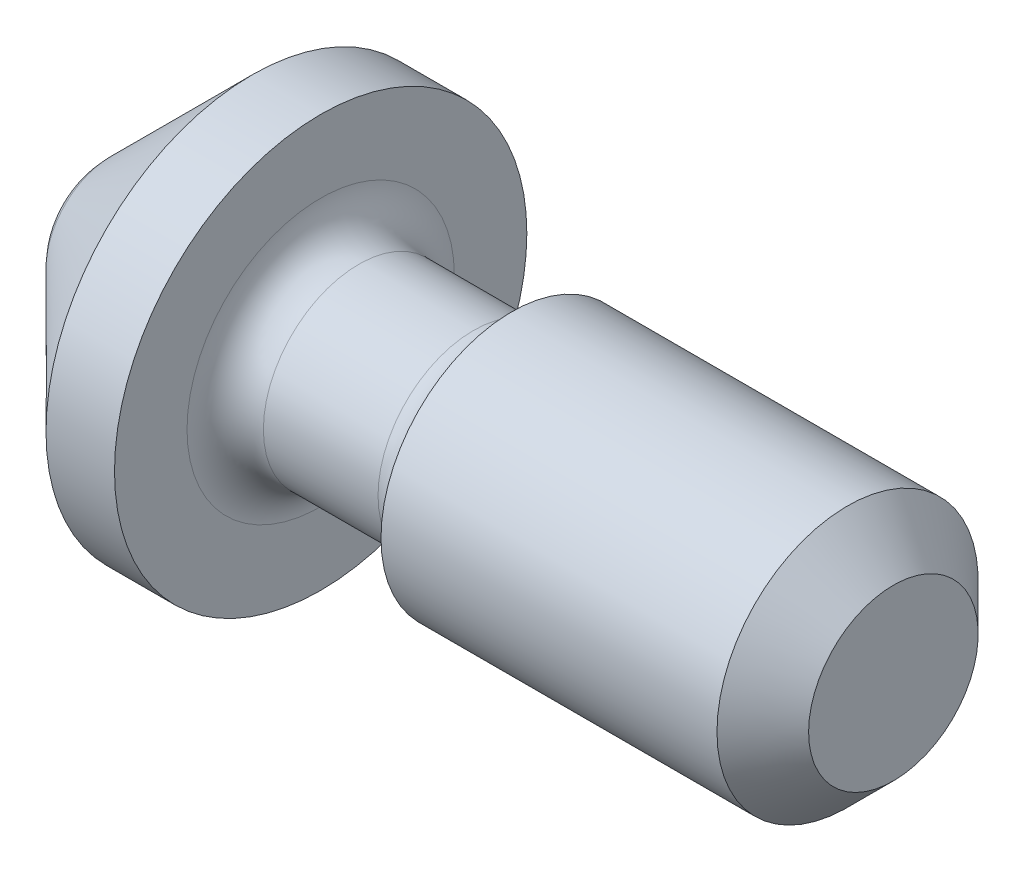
ISO-10303-21;
HEADER;
FILE_DESCRIPTION(('STEP AP214'),'2;1');
FILE_NAME('part.step','',(''),(''),'','','');
FILE_SCHEMA(('AUTOMOTIVE_DESIGN { 1 0 10303 214 1 1 1 1 }'));
ENDSEC;
DATA;
#1=APPLICATION_CONTEXT('core data for automotive mechanical design processes');
#2=APPLICATION_PROTOCOL_DEFINITION('international standard','automotive_design',2000,#1);
#3=PRODUCT_CONTEXT('',#1,'mechanical');
#4=PRODUCT('Part','Part','',(#3));
#5=PRODUCT_RELATED_PRODUCT_CATEGORY('part','',(#4));
#6=PRODUCT_DEFINITION_FORMATION('','',#4);
#7=PRODUCT_DEFINITION_CONTEXT('part definition',#1,'design');
#8=PRODUCT_DEFINITION('design','',#6,#7);
#9=PRODUCT_DEFINITION_SHAPE('','',#8);
#10=(LENGTH_UNIT() NAMED_UNIT(*) SI_UNIT(.MILLI.,.METRE.));
#11=(NAMED_UNIT(*) PLANE_ANGLE_UNIT() SI_UNIT($,.RADIAN.));
#12=(NAMED_UNIT(*) SI_UNIT($,.STERADIAN.) SOLID_ANGLE_UNIT());
#13=UNCERTAINTY_MEASURE_WITH_UNIT(LENGTH_MEASURE(1.E-05),#10,'distance_accuracy_value','');
#14=(GEOMETRIC_REPRESENTATION_CONTEXT(3) GLOBAL_UNCERTAINTY_ASSIGNED_CONTEXT((#13)) GLOBAL_UNIT_ASSIGNED_CONTEXT((#10,
#11,#12)) REPRESENTATION_CONTEXT('',''));
#15=CARTESIAN_POINT('',(0.,0.,0.));
#16=DIRECTION('',(0.,0.,1.));
#17=DIRECTION('',(1.,0.,0.));
#18=AXIS2_PLACEMENT_3D('',#15,#16,#17);
#19=CARTESIAN_POINT('',(1.524,0.,0.));
#20=DIRECTION('',(-1.,0.,0.));
#21=DIRECTION('',(0.,1.,0.));
#22=AXIS2_PLACEMENT_3D('',#19,#20,#21);
#23=SPHERICAL_SURFACE('',#22,1.524);
#24=CARTESIAN_POINT('',(0.446369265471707,0.,0.));
#25=DIRECTION('',(-1.,0.,0.));
#26=DIRECTION('',(0.,0.,1.));
#27=AXIS2_PLACEMENT_3D('',#24,#25,#26);
#28=CIRCLE('',#27,1.0776307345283);
#29=CARTESIAN_POINT('',(0.446369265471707,0.,-1.0776307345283));
#30=VERTEX_POINT('',#29);
#31=EDGE_CURVE('E61',#30,#30,#28,.T.);
#32=ORIENTED_EDGE('',*,*,#31,.T.);
#33=EDGE_LOOP('',(#32));
#34=FACE_BOUND('',#33,.T.);
#35=ADVANCED_FACE('F29',(#34),#23,.T.);
#36=CARTESIAN_POINT('',(13.462,0.,0.));
#37=DIRECTION('',(-1.,0.,0.));
#38=DIRECTION('',(0.,0.,1.));
#39=AXIS2_PLACEMENT_3D('',#36,#37,#38);
#40=PLANE('',#39);
#41=CARTESIAN_POINT('',(13.462,0.,0.));
#42=DIRECTION('',(-1.,0.,0.));
#43=DIRECTION('',(0.,0.,1.));
#44=AXIS2_PLACEMENT_3D('',#41,#42,#43);
#45=CIRCLE('',#44,1.41);
#46=CARTESIAN_POINT('',(13.462,0.,1.41));
#47=VERTEX_POINT('',#46);
#48=EDGE_CURVE('E44',#47,#47,#45,.F.);
#49=ORIENTED_EDGE('',*,*,#48,.T.);
#50=EDGE_LOOP('',(#49));
#51=FACE_BOUND('',#50,.T.);
#52=ADVANCED_FACE('F90',(#51),#40,.F.);
#53=CARTESIAN_POINT('',(0.,0.,0.));
#54=DIRECTION('',(-1.,0.,0.));
#55=DIRECTION('',(0.,0.,1.));
#56=AXIS2_PLACEMENT_3D('',#53,#54,#55);
#57=CYLINDRICAL_SURFACE('',#56,2.172);
#58=CARTESIAN_POINT('',(12.7,0.,0.));
#59=DIRECTION('',(-1.,0.,0.));
#60=DIRECTION('',(0.,0.,1.));
#61=AXIS2_PLACEMENT_3D('',#58,#59,#60);
#62=CIRCLE('',#61,2.172);
#63=CARTESIAN_POINT('',(12.7,0.,2.172));
#64=VERTEX_POINT('',#63);
#65=EDGE_CURVE('E49',#64,#64,#62,.T.);
#66=ORIENTED_EDGE('',*,*,#65,.T.);
#67=EDGE_LOOP('',(#66));
#68=FACE_BOUND('',#67,.T.);
#69=CARTESIAN_POINT('',(7.112,0.,0.));
#70=DIRECTION('',(-1.,0.,0.));
#71=DIRECTION('',(0.,0.,1.));
#72=AXIS2_PLACEMENT_3D('',#69,#70,#71);
#73=CIRCLE('',#72,2.172);
#74=CARTESIAN_POINT('',(7.112,0.,2.172));
#75=VERTEX_POINT('',#74);
#76=EDGE_CURVE('E52',#75,#75,#73,.T.);
#77=ORIENTED_EDGE('',*,*,#76,.F.);
#78=EDGE_LOOP('',(#77));
#79=FACE_BOUND('',#78,.T.);
#80=ADVANCED_FACE('F87',(#68,#79),#57,.T.);
#81=CARTESIAN_POINT('',(0.,0.,0.));
#82=DIRECTION('',(-1.,0.,0.));
#83=DIRECTION('',(0.,0.,1.));
#84=AXIS2_PLACEMENT_3D('',#81,#82,#83);
#85=CYLINDRICAL_SURFACE('',#84,1.588);
#86=CARTESIAN_POINT('',(4.572,0.,0.));
#87=DIRECTION('',(-1.,0.,0.));
#88=DIRECTION('',(0.,0.,1.));
#89=AXIS2_PLACEMENT_3D('',#86,#87,#88);
#90=CIRCLE('',#89,1.588);
#91=CARTESIAN_POINT('',(4.572,0.,1.588));
#92=VERTEX_POINT('',#91);
#93=EDGE_CURVE('E10',#92,#92,#90,.F.);
#94=ORIENTED_EDGE('',*,*,#93,.T.);
#95=EDGE_LOOP('',(#94));
#96=FACE_BOUND('',#95,.T.);
#97=CARTESIAN_POINT('',(6.47905134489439,0.,0.));
#98=DIRECTION('',(1.,0.,0.));
#99=DIRECTION('',(0.,0.,-1.));
#100=AXIS2_PLACEMENT_3D('',#97,#98,#99);
#101=CIRCLE('',#100,1.588);
#102=CARTESIAN_POINT('',(6.47905134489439,0.,-1.588));
#103=VERTEX_POINT('',#102);
#104=EDGE_CURVE('E36',#103,#103,#101,.F.);
#105=ORIENTED_EDGE('',*,*,#104,.T.);
#106=EDGE_LOOP('',(#105));
#107=FACE_BOUND('',#106,.T.);
#108=ADVANCED_FACE('F81',(#96,#107),#85,.T.);
#109=CARTESIAN_POINT('',(3.937,1.588,0.));
#110=DIRECTION('',(-1.,0.,0.));
#111=DIRECTION('',(0.,0.,1.));
#112=AXIS2_PLACEMENT_3D('',#109,#110,#111);
#113=PLANE('',#112);
#114=CARTESIAN_POINT('',(3.937,0.,0.));
#115=DIRECTION('',(-1.,0.,0.));
#116=DIRECTION('',(0.,0.,1.));
#117=AXIS2_PLACEMENT_3D('',#114,#115,#116);
#118=CIRCLE('',#117,2.223);
#119=CARTESIAN_POINT('',(3.937,0.,2.223));
#120=VERTEX_POINT('',#119);
#121=EDGE_CURVE('E40',#120,#120,#118,.T.);
#122=ORIENTED_EDGE('',*,*,#121,.T.);
#123=EDGE_LOOP('',(#122));
#124=FACE_BOUND('',#123,.T.);
#125=CARTESIAN_POINT('',(3.937,0.,0.));
#126=DIRECTION('',(-1.,0.,0.));
#127=DIRECTION('',(0.,0.,1.));
#128=AXIS2_PLACEMENT_3D('',#125,#126,#127);
#129=CIRCLE('',#128,3.429);
#130=CARTESIAN_POINT('',(3.937,0.,3.429));
#131=VERTEX_POINT('',#130);
#132=EDGE_CURVE('E55',#131,#131,#129,.T.);
#133=ORIENTED_EDGE('',*,*,#132,.F.);
#134=EDGE_LOOP('',(#133));
#135=FACE_BOUND('',#134,.T.);
#136=ADVANCED_FACE('F76',(#124,#135),#113,.F.);
#137=CARTESIAN_POINT('',(0.,0.,0.));
#138=DIRECTION('',(-1.,0.,0.));
#139=DIRECTION('',(0.,0.,1.));
#140=AXIS2_PLACEMENT_3D('',#137,#138,#139);
#141=CYLINDRICAL_SURFACE('',#140,3.429);
#142=CARTESIAN_POINT('',(2.79773853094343,0.,0.));
#143=DIRECTION('',(-1.,0.,0.));
#144=DIRECTION('',(0.,0.,1.));
#145=AXIS2_PLACEMENT_3D('',#142,#143,#144);
#146=CIRCLE('',#145,3.429);
#147=CARTESIAN_POINT('',(2.79773853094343,0.,-3.429));
#148=VERTEX_POINT('',#147);
#149=EDGE_CURVE('E58',#148,#148,#146,.T.);
#150=ORIENTED_EDGE('',*,*,#149,.F.);
#151=EDGE_LOOP('',(#150));
#152=FACE_BOUND('',#151,.T.);
#153=ORIENTED_EDGE('',*,*,#132,.T.);
#154=EDGE_LOOP('',(#153));
#155=FACE_BOUND('',#154,.T.);
#156=ADVANCED_FACE('F70',(#152,#155),#141,.T.);
#157=CARTESIAN_POINT('',(2.79773853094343,0.,0.));
#158=DIRECTION('',(1.,0.,0.));
#159=DIRECTION('',(0.,0.,-1.));
#160=AXIS2_PLACEMENT_3D('',#157,#158,#159);
#161=CONICAL_SURFACE('',#160,3.429,0.785398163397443);
#162=CARTESIAN_POINT('',(0.446369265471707,0.,-1.0776307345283));
#163=CARTESIAN_POINT('',(0.470862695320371,0.,-1.10212416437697));
#164=CARTESIAN_POINT('',(0.495356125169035,0.,-1.12661759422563));
#165=CARTESIAN_POINT('',(0.544342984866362,0.,-1.17560445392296));
#166=CARTESIAN_POINT('',(0.568836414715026,0.,-1.20009788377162));
#167=CARTESIAN_POINT('',(0.617823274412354,0.,-1.24908474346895));
#168=CARTESIAN_POINT('',(0.642316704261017,0.,-1.27357817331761));
#169=CARTESIAN_POINT('',(0.691303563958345,0.,-1.32256503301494));
#170=CARTESIAN_POINT('',(0.715796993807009,0.,-1.3470584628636));
#171=CARTESIAN_POINT('',(0.764783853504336,0.,-1.39604532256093));
#172=CARTESIAN_POINT('',(0.789277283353,0.,-1.42053875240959));
#173=CARTESIAN_POINT('',(0.838264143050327,0.,-1.46952561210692));
#174=CARTESIAN_POINT('',(0.862757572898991,0.,-1.49401904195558));
#175=CARTESIAN_POINT('',(0.911744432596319,0.,-1.54300590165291));
#176=CARTESIAN_POINT('',(0.936237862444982,0.,-1.56749933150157));
#177=CARTESIAN_POINT('',(0.98522472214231,0.,-1.6164861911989));
#178=CARTESIAN_POINT('',(1.00971815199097,0.,-1.64097962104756));
#179=CARTESIAN_POINT('',(1.0587050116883,0.,-1.68996648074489));
#180=CARTESIAN_POINT('',(1.08319844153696,0.,-1.71445991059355));
#181=CARTESIAN_POINT('',(1.13218530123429,0.,-1.76344677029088));
#182=CARTESIAN_POINT('',(1.15667873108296,0.,-1.78794020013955));
#183=CARTESIAN_POINT('',(1.20566559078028,0.,-1.83692705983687));
#184=CARTESIAN_POINT('',(1.23015902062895,0.,-1.86142048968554));
#185=CARTESIAN_POINT('',(1.27914588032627,0.,-1.91040734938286));
#186=CARTESIAN_POINT('',(1.30363931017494,0.,-1.93490077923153));
#187=CARTESIAN_POINT('',(1.35262616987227,0.,-1.98388763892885));
#188=CARTESIAN_POINT('',(1.37711959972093,0.,-2.00838106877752));
#189=CARTESIAN_POINT('',(1.42610645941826,0.,-2.05736792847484));
#190=CARTESIAN_POINT('',(1.45059988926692,0.,-2.08186135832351));
#191=CARTESIAN_POINT('',(1.49958674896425,0.,-2.13084821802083));
#192=CARTESIAN_POINT('',(1.52408017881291,0.,-2.1553416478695));
#193=CARTESIAN_POINT('',(1.57306703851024,0.,-2.20432850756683));
#194=CARTESIAN_POINT('',(1.5975604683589,0.,-2.22882193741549));
#195=CARTESIAN_POINT('',(1.64654732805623,0.,-2.27780879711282));
#196=CARTESIAN_POINT('',(1.67104075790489,0.,-2.30230222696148));
#197=CARTESIAN_POINT('',(1.72002761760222,0.,-2.35128908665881));
#198=CARTESIAN_POINT('',(1.74452104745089,0.,-2.37578251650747));
#199=CARTESIAN_POINT('',(1.79350790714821,0.,-2.4247693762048));
#200=CARTESIAN_POINT('',(1.81800133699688,0.,-2.44926280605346));
#201=CARTESIAN_POINT('',(1.86698819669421,0.,-2.49824966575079));
#202=CARTESIAN_POINT('',(1.89148162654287,0.,-2.52274309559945));
#203=CARTESIAN_POINT('',(1.9404684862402,0.,-2.57172995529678));
#204=CARTESIAN_POINT('',(1.96496191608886,0.,-2.59622338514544));
#205=CARTESIAN_POINT('',(2.01394877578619,0.,-2.64521024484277));
#206=CARTESIAN_POINT('',(2.03844220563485,0.,-2.66970367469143));
#207=CARTESIAN_POINT('',(2.08742906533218,0.,-2.71869053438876));
#208=CARTESIAN_POINT('',(2.11192249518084,0.,-2.74318396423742));
#209=CARTESIAN_POINT('',(2.16090935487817,0.,-2.79217082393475));
#210=CARTESIAN_POINT('',(2.18540278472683,0.,-2.81666425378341));
#211=CARTESIAN_POINT('',(2.23438964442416,0.,-2.86565111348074));
#212=CARTESIAN_POINT('',(2.25888307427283,0.,-2.8901445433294));
#213=CARTESIAN_POINT('',(2.30786993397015,0.,-2.93913140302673));
#214=CARTESIAN_POINT('',(2.33236336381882,0.,-2.96362483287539));
#215=CARTESIAN_POINT('',(2.38135022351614,0.,-3.01261169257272));
#216=CARTESIAN_POINT('',(2.40584365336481,0.,-3.03710512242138));
#217=CARTESIAN_POINT('',(2.45483051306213,0.,-3.08609198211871));
#218=CARTESIAN_POINT('',(2.4793239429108,0.,-3.11058541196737));
#219=CARTESIAN_POINT('',(2.52831080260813,0.,-3.1595722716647));
#220=CARTESIAN_POINT('',(2.55280423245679,0.,-3.18406570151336));
#221=CARTESIAN_POINT('',(2.60179109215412,0.,-3.23305256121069));
#222=CARTESIAN_POINT('',(2.62628452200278,0.,-3.25754599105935));
#223=CARTESIAN_POINT('',(2.67527138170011,0.,-3.30653285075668));
#224=CARTESIAN_POINT('',(2.69976481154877,0.,-3.33102628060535));
#225=CARTESIAN_POINT('',(2.7487516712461,0.,-3.38001314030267));
#226=CARTESIAN_POINT('',(2.77324510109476,0.,-3.40450657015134));
#227=CARTESIAN_POINT('',(2.79773853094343,0.,-3.429));
#228=B_SPLINE_CURVE_WITH_KNOTS('',3,(#162,#163,#164,#165,#166,#167,#168,#169,#170,#171,#172,
#173,#174,#175,#176,#177,#178,#179,#180,#181,#182,#183,#184,#185,#186,#187,#188,#189,#190,#191,
#192,#193,#194,#195,#196,#197,#198,#199,#200,#201,#202,#203,#204,#205,#206,#207,#208,#209,#210,
#211,#212,#213,#214,#215,#216,#217,#218,#219,#220,#221,#222,#223,#224,#225,#226,#227),
.UNSPECIFIED.,.F.,.F.,(4,2,2,2,2,2,2,2,2,2,2,2,2,2,2,2,2,2,2,2,2,2,2,2,2,2,2,2,2,2,2,2,4),(0.,
0.103916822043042,0.207833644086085,0.311750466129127,0.415667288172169,0.519584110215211,
0.623500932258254,0.727417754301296,0.831334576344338,0.93525139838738,1.03916822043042,
1.14308504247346,1.24700186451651,1.35091868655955,1.45483550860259,1.55875233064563,
1.66266915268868,1.76658597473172,1.87050279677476,1.9744196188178,2.07833644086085,
2.18225326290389,2.28617008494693,2.39008690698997,2.49400372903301,2.59792055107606,
2.7018373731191,2.80575419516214,2.90967101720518,3.01358783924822,3.11750466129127,
3.22142148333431,3.32533830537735),.UNSPECIFIED.);
#229=EDGE_CURVE('BSEAM66',#30,#148,#228,.T.);
#230=ORIENTED_EDGE('',*,*,#31,.F.);
#231=ORIENTED_EDGE('',*,*,#149,.T.);
#232=ORIENTED_EDGE('',*,*,#229,.T.);
#233=ORIENTED_EDGE('',*,*,#229,.F.);
#234=EDGE_LOOP('',(#230,#232,#231,#233));
#235=FACE_BOUND('',#234,.T.);
#236=ADVANCED_FACE('F66',(#235),#161,.T.);
#237=CARTESIAN_POINT('',(12.7,0.,0.));
#238=DIRECTION('',(-1.,0.,0.));
#239=DIRECTION('',(0.,0.,1.));
#240=AXIS2_PLACEMENT_3D('',#237,#238,#239);
#241=CONICAL_SURFACE('',#240,2.172,0.785398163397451);
#242=ORIENTED_EDGE('',*,*,#48,.F.);
#243=EDGE_LOOP('',(#242));
#244=FACE_BOUND('',#243,.T.);
#245=ORIENTED_EDGE('',*,*,#65,.F.);
#246=EDGE_LOOP('',(#245));
#247=FACE_BOUND('',#246,.T.);
#248=ADVANCED_FACE('F69',(#244,#247),#241,.T.);
#249=CARTESIAN_POINT('',(4.572,0.,0.));
#250=DIRECTION('',(-1.,0.,0.));
#251=DIRECTION('',(0.,0.,1.));
#252=AXIS2_PLACEMENT_3D('',#249,#250,#251);
#253=TOROIDAL_SURFACE('',#252,2.223,0.635);
#254=ORIENTED_EDGE('',*,*,#93,.F.);
#255=EDGE_LOOP('',(#254));
#256=FACE_BOUND('',#255,.T.);
#257=ORIENTED_EDGE('',*,*,#121,.F.);
#258=EDGE_LOOP('',(#257));
#259=FACE_BOUND('',#258,.T.);
#260=ADVANCED_FACE('F100',(#256,#259),#253,.F.);
#261=CARTESIAN_POINT('',(6.47905134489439,0.,0.));
#262=DIRECTION('',(1.,0.,0.));
#263=DIRECTION('',(0.,0.,-1.));
#264=AXIS2_PLACEMENT_3D('',#261,#262,#263);
#265=TOROIDAL_SURFACE('',#264,2.223,0.635);
#266=ORIENTED_EDGE('',*,*,#76,.T.);
#267=EDGE_LOOP('',(#266));
#268=FACE_BOUND('',#267,.T.);
#269=ORIENTED_EDGE('',*,*,#104,.F.);
#270=EDGE_LOOP('',(#269));
#271=FACE_BOUND('',#270,.T.);
#272=ADVANCED_FACE('F31',(#268,#271),#265,.F.);
#273=CLOSED_SHELL('',(#35,#52,#80,#108,#136,#156,#236,#248,#260,#272));
#274=MANIFOLD_SOLID_BREP('B2',#273);
#275=ADVANCED_BREP_SHAPE_REPRESENTATION('',(#18,#274),#14);
#276=SHAPE_DEFINITION_REPRESENTATION(#9,#275);
ENDSEC;
END-ISO-10303-21;
